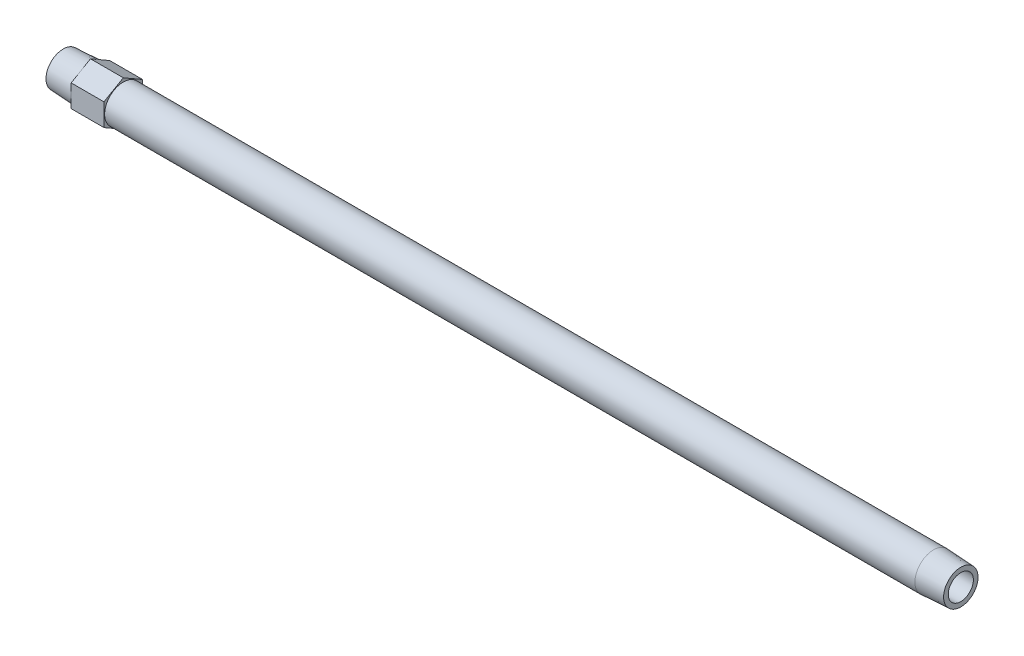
ISO-10303-21;
HEADER;
FILE_DESCRIPTION(('STEP AP214'),'2;1');
FILE_NAME('part.step','',(''),(''),'','','');
FILE_SCHEMA(('AUTOMOTIVE_DESIGN { 1 0 10303 214 1 1 1 1 }'));
ENDSEC;
DATA;
#1=APPLICATION_CONTEXT('core data for automotive mechanical design processes');
#2=APPLICATION_PROTOCOL_DEFINITION('international standard','automotive_design',2000,#1);
#3=PRODUCT_CONTEXT('',#1,'mechanical');
#4=PRODUCT('Part','Part','',(#3));
#5=PRODUCT_RELATED_PRODUCT_CATEGORY('part','',(#4));
#6=PRODUCT_DEFINITION_FORMATION('','',#4);
#7=PRODUCT_DEFINITION_CONTEXT('part definition',#1,'design');
#8=PRODUCT_DEFINITION('design','',#6,#7);
#9=PRODUCT_DEFINITION_SHAPE('','',#8);
#10=(LENGTH_UNIT() NAMED_UNIT(*) SI_UNIT(.MILLI.,.METRE.));
#11=(NAMED_UNIT(*) PLANE_ANGLE_UNIT() SI_UNIT($,.RADIAN.));
#12=(NAMED_UNIT(*) SI_UNIT($,.STERADIAN.) SOLID_ANGLE_UNIT());
#13=UNCERTAINTY_MEASURE_WITH_UNIT(LENGTH_MEASURE(1.E-05),#10,'distance_accuracy_value','');
#14=(GEOMETRIC_REPRESENTATION_CONTEXT(3) GLOBAL_UNCERTAINTY_ASSIGNED_CONTEXT((#13)) GLOBAL_UNIT_ASSIGNED_CONTEXT((#10,
#11,#12)) REPRESENTATION_CONTEXT('',''));
#15=CARTESIAN_POINT('',(0.,0.,0.));
#16=DIRECTION('',(0.,0.,1.));
#17=DIRECTION('',(1.,0.,0.));
#18=AXIS2_PLACEMENT_3D('',#15,#16,#17);
#19=CARTESIAN_POINT('',(0.,0.,-6.3321927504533));
#20=DIRECTION('',(1.,0.,0.));
#21=DIRECTION('',(0.,0.,-1.));
#22=AXIS2_PLACEMENT_3D('',#19,#20,#21);
#23=PLANE('',#22);
#24=CARTESIAN_POINT('',(0.,0.,0.));
#25=DIRECTION('',(-1.,0.,0.));
#26=DIRECTION('',(0.,0.,1.));
#27=AXIS2_PLACEMENT_3D('',#24,#25,#26);
#28=CIRCLE('',#27,6.3321927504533);
#29=CARTESIAN_POINT('',(0.,0.,6.3321927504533));
#30=VERTEX_POINT('',#29);
#31=EDGE_CURVE('E147',#30,#30,#28,.T.);
#32=ORIENTED_EDGE('',*,*,#31,.T.);
#33=EDGE_LOOP('',(#32));
#34=FACE_BOUND('',#33,.T.);
#35=CARTESIAN_POINT('',(0.,0.,0.));
#36=DIRECTION('',(1.,0.,0.));
#37=DIRECTION('',(0.,0.,1.));
#38=AXIS2_PLACEMENT_3D('',#35,#36,#37);
#39=CIRCLE('',#38,4.6228);
#40=CARTESIAN_POINT('',(0.,0.,4.6228));
#41=VERTEX_POINT('',#40);
#42=EDGE_CURVE('E159',#41,#41,#39,.T.);
#43=ORIENTED_EDGE('',*,*,#42,.T.);
#44=EDGE_LOOP('',(#43));
#45=FACE_BOUND('',#44,.T.);
#46=ADVANCED_FACE('F15',(#34,#45),#23,.F.);
#47=CARTESIAN_POINT('',(330.2,0.,-6.33219275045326));
#48=DIRECTION('',(-1.,0.,0.));
#49=DIRECTION('',(0.,0.,1.));
#50=AXIS2_PLACEMENT_3D('',#47,#48,#49);
#51=PLANE('',#50);
#52=CARTESIAN_POINT('',(330.2,0.,0.));
#53=DIRECTION('',(-1.,0.,0.));
#54=DIRECTION('',(0.,0.,1.));
#55=AXIS2_PLACEMENT_3D('',#52,#53,#54);
#56=CIRCLE('',#55,6.33219275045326);
#57=CARTESIAN_POINT('',(330.2,0.,6.33219275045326));
#58=VERTEX_POINT('',#57);
#59=EDGE_CURVE('E150',#58,#58,#56,.T.);
#60=ORIENTED_EDGE('',*,*,#59,.F.);
#61=EDGE_LOOP('',(#60));
#62=FACE_BOUND('',#61,.T.);
#63=CARTESIAN_POINT('',(330.2,0.,0.));
#64=DIRECTION('',(-1.,0.,0.));
#65=DIRECTION('',(0.,0.,1.));
#66=AXIS2_PLACEMENT_3D('',#63,#64,#65);
#67=CIRCLE('',#66,4.6228);
#68=CARTESIAN_POINT('',(330.2,0.,4.6228));
#69=VERTEX_POINT('',#68);
#70=EDGE_CURVE('E156',#69,#69,#67,.F.);
#71=ORIENTED_EDGE('',*,*,#70,.F.);
#72=EDGE_LOOP('',(#71));
#73=FACE_BOUND('',#72,.T.);
#74=ADVANCED_FACE('F178',(#62,#73),#51,.F.);
#75=CARTESIAN_POINT('',(22.098,-12.3183453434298,7.112));
#76=DIRECTION('',(-1.,0.,0.));
#77=DIRECTION('',(0.,-1.,0.));
#78=AXIS2_PLACEMENT_3D('',#75,#76,#77);
#79=PLANE('',#78);
#80=DIRECTION('',(0.,0.5,-0.866025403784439));
#81=VECTOR('',#80,1.);
#82=CARTESIAN_POINT('',(22.098,-8.21223022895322,0.));
#83=LINE('',#82,#81);
#84=CARTESIAN_POINT('',(22.098,-8.21223022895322,0.));
#85=VERTEX_POINT('',#84);
#86=CARTESIAN_POINT('',(22.098,-4.10611511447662,-7.112));
#87=VERTEX_POINT('',#86);
#88=EDGE_CURVE('E103',#85,#87,#83,.T.);
#89=ORIENTED_EDGE('',*,*,#88,.T.);
#90=DIRECTION('',(0.,1.,0.));
#91=VECTOR('',#90,1.);
#92=CARTESIAN_POINT('',(22.098,-4.10611511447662,-7.112));
#93=LINE('',#92,#91);
#94=CARTESIAN_POINT('',(22.098,4.10611511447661,-7.112));
#95=VERTEX_POINT('',#94);
#96=EDGE_CURVE('E83',#87,#95,#93,.T.);
#97=ORIENTED_EDGE('',*,*,#96,.T.);
#98=DIRECTION('',(0.,0.5,0.866025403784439));
#99=VECTOR('',#98,1.);
#100=CARTESIAN_POINT('',(22.098,4.10611511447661,-7.112));
#101=LINE('',#100,#99);
#102=CARTESIAN_POINT('',(22.098,8.21223022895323,0.));
#103=VERTEX_POINT('',#102);
#104=EDGE_CURVE('E102',#95,#103,#101,.T.);
#105=ORIENTED_EDGE('',*,*,#104,.T.);
#106=DIRECTION('',(0.,-0.5,0.866025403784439));
#107=VECTOR('',#106,1.);
#108=CARTESIAN_POINT('',(22.098,8.21223022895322,0.));
#109=LINE('',#108,#107);
#110=CARTESIAN_POINT('',(22.098,4.10611511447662,7.112));
#111=VERTEX_POINT('',#110);
#112=EDGE_CURVE('E105',#103,#111,#109,.T.);
#113=ORIENTED_EDGE('',*,*,#112,.T.);
#114=DIRECTION('',(0.,-1.,0.));
#115=VECTOR('',#114,1.);
#116=CARTESIAN_POINT('',(22.098,4.10611511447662,7.112));
#117=LINE('',#116,#115);
#118=CARTESIAN_POINT('',(22.098,-4.10611511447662,7.112));
#119=VERTEX_POINT('',#118);
#120=EDGE_CURVE('E35',#111,#119,#117,.T.);
#121=ORIENTED_EDGE('',*,*,#120,.T.);
#122=DIRECTION('',(0.,-0.5,-0.866025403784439));
#123=VECTOR('',#122,1.);
#124=CARTESIAN_POINT('',(22.098,-4.10611511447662,7.112));
#125=LINE('',#124,#123);
#126=EDGE_CURVE('E30',#119,#85,#125,.T.);
#127=ORIENTED_EDGE('',*,*,#126,.T.);
#128=EDGE_LOOP('',(#89,#97,#105,#113,#121,#127));
#129=FACE_BOUND('',#128,.T.);
#130=CARTESIAN_POINT('',(22.098,0.,0.));
#131=DIRECTION('',(-1.,0.,0.));
#132=DIRECTION('',(0.,-1.,0.));
#133=AXIS2_PLACEMENT_3D('',#130,#131,#132);
#134=CIRCLE('',#133,6.858);
#135=CARTESIAN_POINT('',(22.098,-6.858,0.));
#136=VERTEX_POINT('',#135);
#137=EDGE_CURVE('E89',#136,#136,#134,.F.);
#138=ORIENTED_EDGE('',*,*,#137,.F.);
#139=EDGE_LOOP('',(#138));
#140=FACE_BOUND('',#139,.T.);
#141=ADVANCED_FACE('F124',(#129,#140),#79,.F.);
#142=CARTESIAN_POINT('',(10.033,-12.3183453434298,7.112));
#143=DIRECTION('',(-1.,0.,0.));
#144=DIRECTION('',(0.,-1.,0.));
#145=AXIS2_PLACEMENT_3D('',#142,#143,#144);
#146=PLANE('',#145);
#147=DIRECTION('',(0.,0.5,-0.866025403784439));
#148=VECTOR('',#147,1.);
#149=CARTESIAN_POINT('',(10.033,-8.21223022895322,0.));
#150=LINE('',#149,#148);
#151=CARTESIAN_POINT('',(10.033,-8.21223022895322,0.));
#152=VERTEX_POINT('',#151);
#153=CARTESIAN_POINT('',(10.033,-4.10611511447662,-7.112));
#154=VERTEX_POINT('',#153);
#155=EDGE_CURVE('E73',#152,#154,#150,.T.);
#156=ORIENTED_EDGE('',*,*,#155,.F.);
#157=DIRECTION('',(0.,-0.5,-0.866025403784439));
#158=VECTOR('',#157,1.);
#159=CARTESIAN_POINT('',(10.033,-4.10611511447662,7.112));
#160=LINE('',#159,#158);
#161=CARTESIAN_POINT('',(10.033,-4.10611511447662,7.112));
#162=VERTEX_POINT('',#161);
#163=EDGE_CURVE('E99',#162,#152,#160,.T.);
#164=ORIENTED_EDGE('',*,*,#163,.F.);
#165=DIRECTION('',(0.,-1.,0.));
#166=VECTOR('',#165,1.);
#167=CARTESIAN_POINT('',(10.033,4.10611511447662,7.112));
#168=LINE('',#167,#166);
#169=CARTESIAN_POINT('',(10.033,4.10611511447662,7.112));
#170=VERTEX_POINT('',#169);
#171=EDGE_CURVE('E133',#170,#162,#168,.T.);
#172=ORIENTED_EDGE('',*,*,#171,.F.);
#173=DIRECTION('',(0.,-0.5,0.866025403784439));
#174=VECTOR('',#173,1.);
#175=CARTESIAN_POINT('',(10.033,8.21223022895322,0.));
#176=LINE('',#175,#174);
#177=CARTESIAN_POINT('',(10.033,8.21223022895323,0.));
#178=VERTEX_POINT('',#177);
#179=EDGE_CURVE('E129',#178,#170,#176,.T.);
#180=ORIENTED_EDGE('',*,*,#179,.F.);
#181=DIRECTION('',(0.,0.5,0.866025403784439));
#182=VECTOR('',#181,1.);
#183=CARTESIAN_POINT('',(10.033,4.10611511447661,-7.112));
#184=LINE('',#183,#182);
#185=CARTESIAN_POINT('',(10.033,4.10611511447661,-7.112));
#186=VERTEX_POINT('',#185);
#187=EDGE_CURVE('E75',#186,#178,#184,.T.);
#188=ORIENTED_EDGE('',*,*,#187,.F.);
#189=DIRECTION('',(0.,1.,0.));
#190=VECTOR('',#189,1.);
#191=CARTESIAN_POINT('',(10.033,-4.10611511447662,-7.112));
#192=LINE('',#191,#190);
#193=EDGE_CURVE('E68',#154,#186,#192,.T.);
#194=ORIENTED_EDGE('',*,*,#193,.F.);
#195=EDGE_LOOP('',(#156,#164,#172,#180,#188,#194));
#196=FACE_BOUND('',#195,.T.);
#197=CARTESIAN_POINT('',(10.033,0.,0.));
#198=DIRECTION('',(-1.,0.,0.));
#199=DIRECTION('',(0.,0.,1.));
#200=AXIS2_PLACEMENT_3D('',#197,#198,#199);
#201=CIRCLE('',#200,6.858);
#202=CARTESIAN_POINT('',(10.033,0.,6.858));
#203=VERTEX_POINT('',#202);
#204=EDGE_CURVE('E95',#203,#203,#201,.T.);
#205=ORIENTED_EDGE('',*,*,#204,.F.);
#206=EDGE_LOOP('',(#205));
#207=FACE_BOUND('',#206,.T.);
#208=ADVANCED_FACE('F69',(#196,#207),#146,.T.);
#209=CARTESIAN_POINT('',(22.098,-8.21223022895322,0.));
#210=DIRECTION('',(0.,0.866025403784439,0.5));
#211=DIRECTION('',(0.,-0.5,0.866025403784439));
#212=AXIS2_PLACEMENT_3D('',#209,#210,#211);
#213=PLANE('',#212);
#214=ORIENTED_EDGE('',*,*,#155,.T.);
#215=DIRECTION('',(-1.,0.,0.));
#216=VECTOR('',#215,1.);
#217=CARTESIAN_POINT('',(22.098,-4.10611511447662,-7.112));
#218=LINE('',#217,#216);
#219=EDGE_CURVE('E10',#87,#154,#218,.T.);
#220=ORIENTED_EDGE('',*,*,#219,.F.);
#221=ORIENTED_EDGE('',*,*,#88,.F.);
#222=DIRECTION('',(-1.,0.,0.));
#223=VECTOR('',#222,1.);
#224=CARTESIAN_POINT('',(22.098,-8.21223022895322,0.));
#225=LINE('',#224,#223);
#226=EDGE_CURVE('E87',#85,#152,#225,.T.);
#227=ORIENTED_EDGE('',*,*,#226,.T.);
#228=EDGE_LOOP('',(#214,#220,#221,#227));
#229=FACE_BOUND('',#228,.T.);
#230=ADVANCED_FACE('F17',(#229),#213,.F.);
#231=CARTESIAN_POINT('',(22.098,-4.10611511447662,-7.112));
#232=DIRECTION('',(0.,0.,1.));
#233=DIRECTION('',(0.,-1.,0.));
#234=AXIS2_PLACEMENT_3D('',#231,#232,#233);
#235=PLANE('',#234);
#236=ORIENTED_EDGE('',*,*,#193,.T.);
#237=DIRECTION('',(-1.,0.,0.));
#238=VECTOR('',#237,1.);
#239=CARTESIAN_POINT('',(22.098,4.10611511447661,-7.112));
#240=LINE('',#239,#238);
#241=EDGE_CURVE('E23',#95,#186,#240,.T.);
#242=ORIENTED_EDGE('',*,*,#241,.F.);
#243=ORIENTED_EDGE('',*,*,#96,.F.);
#244=ORIENTED_EDGE('',*,*,#219,.T.);
#245=EDGE_LOOP('',(#236,#242,#243,#244));
#246=FACE_BOUND('',#245,.T.);
#247=ADVANCED_FACE('F82',(#246),#235,.F.);
#248=CARTESIAN_POINT('',(22.098,4.10611511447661,-7.112));
#249=DIRECTION('',(0.,-0.866025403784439,0.5));
#250=DIRECTION('',(0.,-0.5,-0.866025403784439));
#251=AXIS2_PLACEMENT_3D('',#248,#249,#250);
#252=PLANE('',#251);
#253=ORIENTED_EDGE('',*,*,#187,.T.);
#254=DIRECTION('',(-1.,0.,0.));
#255=VECTOR('',#254,1.);
#256=CARTESIAN_POINT('',(22.098,8.21223022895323,0.));
#257=LINE('',#256,#255);
#258=EDGE_CURVE('E117',#103,#178,#257,.T.);
#259=ORIENTED_EDGE('',*,*,#258,.F.);
#260=ORIENTED_EDGE('',*,*,#104,.F.);
#261=ORIENTED_EDGE('',*,*,#241,.T.);
#262=EDGE_LOOP('',(#253,#259,#260,#261));
#263=FACE_BOUND('',#262,.T.);
#264=ADVANCED_FACE('F121',(#263),#252,.F.);
#265=CARTESIAN_POINT('',(22.098,8.21223022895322,0.));
#266=DIRECTION('',(0.,-0.866025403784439,-0.5));
#267=DIRECTION('',(0.,0.5,-0.866025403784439));
#268=AXIS2_PLACEMENT_3D('',#265,#266,#267);
#269=PLANE('',#268);
#270=ORIENTED_EDGE('',*,*,#179,.T.);
#271=DIRECTION('',(-1.,0.,0.));
#272=VECTOR('',#271,1.);
#273=CARTESIAN_POINT('',(22.098,4.10611511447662,7.112));
#274=LINE('',#273,#272);
#275=EDGE_CURVE('E114',#111,#170,#274,.T.);
#276=ORIENTED_EDGE('',*,*,#275,.F.);
#277=ORIENTED_EDGE('',*,*,#112,.F.);
#278=ORIENTED_EDGE('',*,*,#258,.T.);
#279=EDGE_LOOP('',(#270,#276,#277,#278));
#280=FACE_BOUND('',#279,.T.);
#281=ADVANCED_FACE('F128',(#280),#269,.F.);
#282=CARTESIAN_POINT('',(22.098,4.10611511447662,7.112));
#283=DIRECTION('',(0.,0.,-1.));
#284=DIRECTION('',(-1.,0.,0.));
#285=AXIS2_PLACEMENT_3D('',#282,#283,#284);
#286=PLANE('',#285);
#287=ORIENTED_EDGE('',*,*,#171,.T.);
#288=DIRECTION('',(-1.,0.,0.));
#289=VECTOR('',#288,1.);
#290=CARTESIAN_POINT('',(22.098,-4.10611511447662,7.112));
#291=LINE('',#290,#289);
#292=EDGE_CURVE('E111',#119,#162,#291,.T.);
#293=ORIENTED_EDGE('',*,*,#292,.F.);
#294=ORIENTED_EDGE('',*,*,#120,.F.);
#295=ORIENTED_EDGE('',*,*,#275,.T.);
#296=EDGE_LOOP('',(#287,#293,#294,#295));
#297=FACE_BOUND('',#296,.T.);
#298=ADVANCED_FACE('F132',(#297),#286,.F.);
#299=CARTESIAN_POINT('',(22.098,-4.10611511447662,7.112));
#300=DIRECTION('',(0.,0.866025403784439,-0.5));
#301=DIRECTION('',(0.,0.5,0.866025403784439));
#302=AXIS2_PLACEMENT_3D('',#299,#300,#301);
#303=PLANE('',#302);
#304=ORIENTED_EDGE('',*,*,#163,.T.);
#305=ORIENTED_EDGE('',*,*,#226,.F.);
#306=ORIENTED_EDGE('',*,*,#126,.F.);
#307=ORIENTED_EDGE('',*,*,#292,.T.);
#308=EDGE_LOOP('',(#304,#305,#306,#307));
#309=FACE_BOUND('',#308,.T.);
#310=ADVANCED_FACE('F135',(#309),#303,.F.);
#311=CARTESIAN_POINT('',(10.033,0.,0.));
#312=DIRECTION('',(1.,0.,0.));
#313=DIRECTION('',(0.,0.,-1.));
#314=AXIS2_PLACEMENT_3D('',#311,#312,#313);
#315=CONICAL_SURFACE('',#314,6.858,0.0523598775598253);
#316=ORIENTED_EDGE('',*,*,#31,.F.);
#317=EDGE_LOOP('',(#316));
#318=FACE_BOUND('',#317,.T.);
#319=ORIENTED_EDGE('',*,*,#204,.T.);
#320=EDGE_LOOP('',(#319));
#321=FACE_BOUND('',#320,.T.);
#322=ADVANCED_FACE('F187',(#318,#321),#315,.T.);
#323=CARTESIAN_POINT('',(-60.,0.,0.));
#324=DIRECTION('',(-1.,0.,0.));
#325=DIRECTION('',(0.,0.,1.));
#326=AXIS2_PLACEMENT_3D('',#323,#324,#325);
#327=CYLINDRICAL_SURFACE('',#326,6.858);
#328=ORIENTED_EDGE('',*,*,#137,.T.);
#329=EDGE_LOOP('',(#328));
#330=FACE_BOUND('',#329,.T.);
#331=CARTESIAN_POINT('',(320.167,0.,0.));
#332=DIRECTION('',(-1.,0.,0.));
#333=DIRECTION('',(0.,0.,1.));
#334=AXIS2_PLACEMENT_3D('',#331,#332,#333);
#335=CIRCLE('',#334,6.858);
#336=CARTESIAN_POINT('',(320.167,0.,6.858));
#337=VERTEX_POINT('',#336);
#338=EDGE_CURVE('E153',#337,#337,#335,.T.);
#339=ORIENTED_EDGE('',*,*,#338,.T.);
#340=EDGE_LOOP('',(#339));
#341=FACE_BOUND('',#340,.T.);
#342=ADVANCED_FACE('F174',(#330,#341),#327,.T.);
#343=CARTESIAN_POINT('',(330.2,0.,0.));
#344=DIRECTION('',(-1.,0.,0.));
#345=DIRECTION('',(0.,0.,1.));
#346=AXIS2_PLACEMENT_3D('',#343,#344,#345);
#347=CONICAL_SURFACE('',#346,6.33219275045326,0.0523598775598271);
#348=ORIENTED_EDGE('',*,*,#338,.F.);
#349=EDGE_LOOP('',(#348));
#350=FACE_BOUND('',#349,.T.);
#351=ORIENTED_EDGE('',*,*,#59,.T.);
#352=EDGE_LOOP('',(#351));
#353=FACE_BOUND('',#352,.T.);
#354=ADVANCED_FACE('F167',(#350,#353),#347,.T.);
#355=CARTESIAN_POINT('',(330.914075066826,0.,0.));
#356=DIRECTION('',(-1.,0.,0.));
#357=DIRECTION('',(0.,0.,1.));
#358=AXIS2_PLACEMENT_3D('',#355,#356,#357);
#359=CYLINDRICAL_SURFACE('',#358,4.6228);
#360=ORIENTED_EDGE('',*,*,#70,.T.);
#361=EDGE_LOOP('',(#360));
#362=FACE_BOUND('',#361,.T.);
#363=ORIENTED_EDGE('',*,*,#42,.F.);
#364=EDGE_LOOP('',(#363));
#365=FACE_BOUND('',#364,.T.);
#366=ADVANCED_FACE('F165',(#362,#365),#359,.F.);
#367=CLOSED_SHELL('',(#46,#74,#141,#208,#230,#247,#264,#281,#298,#310,#322,#342,#354,#366));
#368=MANIFOLD_SOLID_BREP('B1',#367);
#369=ADVANCED_BREP_SHAPE_REPRESENTATION('',(#18,#368),#14);
#370=SHAPE_DEFINITION_REPRESENTATION(#9,#369);
ENDSEC;
END-ISO-10303-21;
